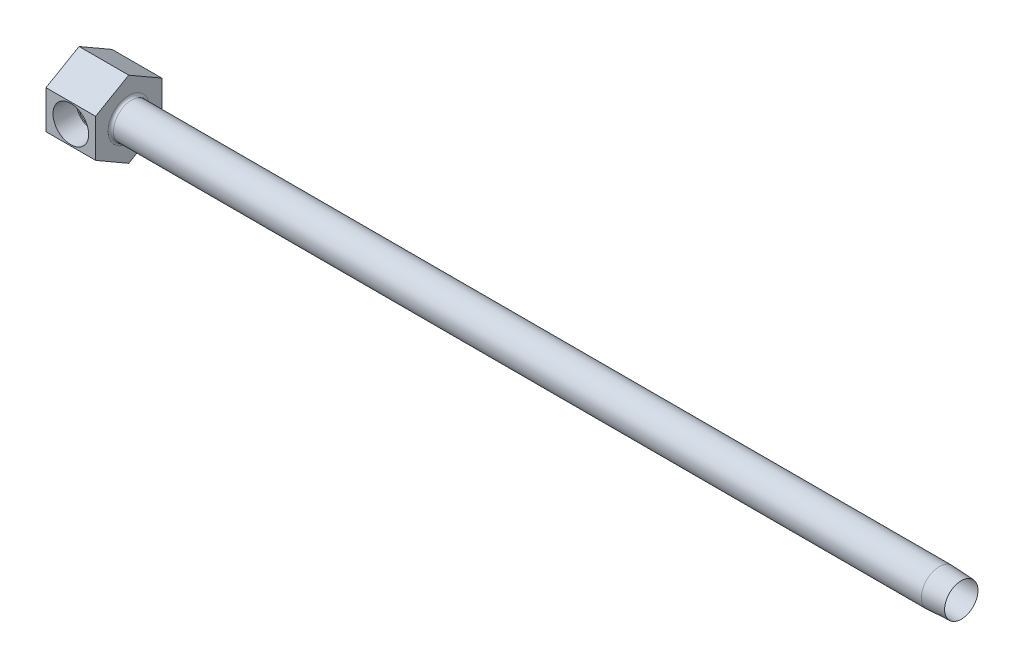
ISO-10303-21;
HEADER;
FILE_DESCRIPTION(('STEP AP214'),'2;1');
FILE_NAME('part.step','',(''),(''),'','','');
FILE_SCHEMA(('AUTOMOTIVE_DESIGN { 1 0 10303 214 1 1 1 1 }'));
ENDSEC;
DATA;
#1=APPLICATION_CONTEXT('core data for automotive mechanical design processes');
#2=APPLICATION_PROTOCOL_DEFINITION('international standard','automotive_design',2000,#1);
#3=PRODUCT_CONTEXT('',#1,'mechanical');
#4=PRODUCT('Part','Part','',(#3));
#5=PRODUCT_RELATED_PRODUCT_CATEGORY('part','',(#4));
#6=PRODUCT_DEFINITION_FORMATION('','',#4);
#7=PRODUCT_DEFINITION_CONTEXT('part definition',#1,'design');
#8=PRODUCT_DEFINITION('design','',#6,#7);
#9=PRODUCT_DEFINITION_SHAPE('','',#8);
#10=(LENGTH_UNIT() NAMED_UNIT(*) SI_UNIT(.MILLI.,.METRE.));
#11=(NAMED_UNIT(*) PLANE_ANGLE_UNIT() SI_UNIT($,.RADIAN.));
#12=(NAMED_UNIT(*) SI_UNIT($,.STERADIAN.) SOLID_ANGLE_UNIT());
#13=UNCERTAINTY_MEASURE_WITH_UNIT(LENGTH_MEASURE(1.E-05),#10,'distance_accuracy_value','');
#14=(GEOMETRIC_REPRESENTATION_CONTEXT(3) GLOBAL_UNCERTAINTY_ASSIGNED_CONTEXT((#13)) GLOBAL_UNIT_ASSIGNED_CONTEXT((#10,
#11,#12)) REPRESENTATION_CONTEXT('',''));
#15=CARTESIAN_POINT('',(0.,0.,0.));
#16=DIRECTION('',(0.,0.,1.));
#17=DIRECTION('',(1.,0.,0.));
#18=AXIS2_PLACEMENT_3D('',#15,#16,#17);
#19=CARTESIAN_POINT('',(63.5,0.,9.525));
#20=DIRECTION('',(1.,0.,0.));
#21=DIRECTION('',(0.,0.,-1.));
#22=AXIS2_PLACEMENT_3D('',#19,#20,#21);
#23=CONICAL_SURFACE('',#22,0.,0.0252477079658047);
#24=CARTESIAN_POINT('',(254.,0.,9.525));
#25=DIRECTION('',(-1.,0.,0.));
#26=DIRECTION('',(0.,0.,1.));
#27=AXIS2_PLACEMENT_3D('',#24,#25,#26);
#28=CIRCLE('',#27,4.81071060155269);
#29=CARTESIAN_POINT('',(254.,0.,14.3357106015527));
#30=VERTEX_POINT('',#29);
#31=EDGE_CURVE('E262',#30,#30,#28,.T.);
#32=ORIENTED_EDGE('',*,*,#31,.F.);
#33=EDGE_LOOP('',(#32));
#34=FACE_BOUND('',#33,.T.);
#35=CARTESIAN_POINT('',(236.374993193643,0.,9.525));
#36=DIRECTION('',(1.,0.,0.));
#37=DIRECTION('',(0.,0.,-1.));
#38=AXIS2_PLACEMENT_3D('',#35,#36,#37);
#39=CIRCLE('',#38,4.365625);
#40=CARTESIAN_POINT('',(236.374993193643,0.,5.159375));
#41=VERTEX_POINT('',#40);
#42=EDGE_CURVE('E111',#41,#41,#39,.T.);
#43=ORIENTED_EDGE('',*,*,#42,.F.);
#44=EDGE_LOOP('',(#43));
#45=FACE_BOUND('',#44,.T.);
#46=ADVANCED_FACE('F15',(#34,#45),#23,.F.);
#47=CARTESIAN_POINT('',(7.14375,0.,19.05));
#48=DIRECTION('',(0.,0.,1.));
#49=DIRECTION('',(1.,0.,0.));
#50=AXIS2_PLACEMENT_3D('',#47,#48,#49);
#51=CONICAL_SURFACE('',#50,5.1435,0.0523598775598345);
#52=CARTESIAN_POINT('',(7.14375,0.,19.05));
#53=DIRECTION('',(0.,0.,-1.));
#54=DIRECTION('',(-1.,0.,0.));
#55=AXIS2_PLACEMENT_3D('',#52,#53,#54);
#56=CIRCLE('',#55,5.1435);
#57=CARTESIAN_POINT('',(2.00025,0.,19.05));
#58=VERTEX_POINT('',#57);
#59=EDGE_CURVE('E290',#58,#58,#56,.T.);
#60=ORIENTED_EDGE('',*,*,#59,.F.);
#61=EDGE_LOOP('',(#60));
#62=FACE_BOUND('',#61,.T.);
#63=CARTESIAN_POINT('',(7.14375,0.,12.7000000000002));
#64=DIRECTION('',(0.,0.,-1.));
#65=DIRECTION('',(-1.,0.,0.));
#66=AXIS2_PLACEMENT_3D('',#63,#64,#65);
#67=CIRCLE('',#66,4.81071060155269);
#68=CARTESIAN_POINT('',(10.9073758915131,-2.99634054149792,12.7000000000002));
#69=VERTEX_POINT('',#68);
#70=CARTESIAN_POINT('',(10.9073758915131,2.99634054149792,12.7000000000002));
#71=VERTEX_POINT('',#70);
#72=EDGE_CURVE('E292',#69,#71,#67,.T.);
#73=ORIENTED_EDGE('',*,*,#72,.T.);
#74=CARTESIAN_POINT('',(10.9071937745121,2.99655245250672,12.6998000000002));
#75=CARTESIAN_POINT('',(10.971635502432,2.92155827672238,12.7705639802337));
#76=CARTESIAN_POINT('',(11.0345784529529,2.84341410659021,12.8393139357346));
#77=CARTESIAN_POINT('',(11.1569073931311,2.68056902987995,12.9723675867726));
#78=CARTESIAN_POINT('',(11.2162880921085,2.59585877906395,13.0366646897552));
#79=CARTESIAN_POINT('',(11.3887731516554,2.33059710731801,13.2228141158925));
#80=CARTESIAN_POINT('',(11.4952955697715,2.13996459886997,13.3369144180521));
#81=CARTESIAN_POINT('',(11.6670238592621,1.76978922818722,13.520146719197));
#82=CARTESIAN_POINT('',(11.7362081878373,1.59429861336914,13.5936668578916));
#83=CARTESIAN_POINT('',(11.8243838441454,1.32069459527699,13.6871793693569));
#84=CARTESIAN_POINT('',(11.8511557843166,1.22786736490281,13.7155347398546));
#85=CARTESIAN_POINT('',(11.8990876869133,1.0391950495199,13.7662595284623));
#86=CARTESIAN_POINT('',(11.9202500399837,0.943351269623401,13.7886314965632));
#87=CARTESIAN_POINT('',(11.9566990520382,0.748466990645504,13.8271421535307));
#88=CARTESIAN_POINT('',(11.971935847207,0.649406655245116,13.8432279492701));
#89=CARTESIAN_POINT('',(11.9959472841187,0.449682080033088,13.8685692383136));
#90=CARTESIAN_POINT('',(12.0047249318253,0.349018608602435,13.8778279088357));
#91=CARTESIAN_POINT('',(12.0156291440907,0.146869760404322,13.8893288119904));
#92=CARTESIAN_POINT('',(12.0177517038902,0.0453839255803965,13.8915668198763));
#93=CARTESIAN_POINT('',(12.0152840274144,-0.157407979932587,13.8889645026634));
#94=CARTESIAN_POINT('',(12.0106943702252,-0.258714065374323,13.8841247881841));
#95=CARTESIAN_POINT('',(11.9957865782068,-0.449057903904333,13.8683984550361));
#96=CARTESIAN_POINT('',(11.9861593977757,-0.538211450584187,13.8582411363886));
#97=CARTESIAN_POINT('',(11.961864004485,-0.715062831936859,13.8325939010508));
#98=CARTESIAN_POINT('',(11.9471941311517,-0.802760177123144,13.8171022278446));
#99=CARTESIAN_POINT('',(11.8959888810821,-1.06271154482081,13.762990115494));
#100=CARTESIAN_POINT('',(11.8522396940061,-1.23204639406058,13.7167134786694));
#101=CARTESIAN_POINT('',(11.7458224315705,-1.56656708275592,13.6038703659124));
#102=CARTESIAN_POINT('',(11.6823922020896,-1.73122409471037,13.5364852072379));
#103=CARTESIAN_POINT('',(11.5406571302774,-2.04618319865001,13.3853583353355));
#104=CARTESIAN_POINT('',(11.4623317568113,-2.19646504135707,13.3015940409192));
#105=CARTESIAN_POINT('',(11.3067680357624,-2.45998630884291,13.1343941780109));
#106=CARTESIAN_POINT('',(11.2311482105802,-2.57539375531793,13.0528153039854));
#107=CARTESIAN_POINT('',(11.0735639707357,-2.79452635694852,12.8818550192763));
#108=CARTESIAN_POINT('',(10.9916301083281,-2.89830245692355,12.792510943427));
#109=CARTESIAN_POINT('',(10.9071937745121,-2.99655245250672,12.6998000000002));
#110=B_SPLINE_CURVE_WITH_KNOTS('',3,(#74,#75,#76,#77,#78,#79,#80,#81,#82,#83,#84,#85,#86,#87,
#88,#89,#90,#91,#92,#93,#94,#95,#96,#97,#98,#99,#100,#101,#102,#103,#104,#105,#106,#107,#108,
#109),.UNSPECIFIED.,.F.,.F.,(4,2,2,2,2,2,2,2,2,2,2,2,2,2,2,2,2,4),(0.,0.364634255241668,
0.72979730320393,1.46525067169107,2.06997219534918,2.37170467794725,2.67330836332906,
2.97739780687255,3.28134564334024,3.58547634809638,3.88958081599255,4.15999530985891,
4.43049893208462,4.97084503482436,5.53548493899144,6.10090884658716,6.58103480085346,
7.05896806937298),.UNSPECIFIED.);
#111=EDGE_CURVE('E121',#71,#69,#110,.T.);
#112=ORIENTED_EDGE('',*,*,#111,.T.);
#113=EDGE_LOOP('',(#73,#112));
#114=FACE_BOUND('',#113,.T.);
#115=ADVANCED_FACE('F173',(#62,#114),#51,.F.);
#116=CARTESIAN_POINT('',(11.9544606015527,0.,12.7000000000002));
#117=DIRECTION('',(0.,0.,1.));
#118=DIRECTION('',(1.,0.,0.));
#119=AXIS2_PLACEMENT_3D('',#116,#117,#118);
#120=PLANE('',#119);
#121=ORIENTED_EDGE('',*,*,#72,.F.);
#122=DIRECTION('',(1.,0.,0.));
#123=VECTOR('',#122,1.);
#124=CARTESIAN_POINT('',(66.1375087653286,-2.99634054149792,12.7000000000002));
#125=LINE('',#124,#123);
#126=CARTESIAN_POINT('',(10.3187500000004,-2.99634054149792,12.7000000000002));
#127=VERTEX_POINT('',#126);
#128=EDGE_CURVE('E118',#69,#127,#125,.F.);
#129=ORIENTED_EDGE('',*,*,#128,.T.);
#130=CARTESIAN_POINT('',(7.14375,0.,12.7000000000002));
#131=DIRECTION('',(0.,0.,-1.));
#132=DIRECTION('',(-1.,0.,0.));
#133=AXIS2_PLACEMENT_3D('',#130,#131,#132);
#134=CIRCLE('',#133,4.36562500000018);
#135=CARTESIAN_POINT('',(10.3187500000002,2.99634054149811,12.7000000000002));
#136=VERTEX_POINT('',#135);
#137=EDGE_CURVE('E117',#127,#136,#134,.T.);
#138=ORIENTED_EDGE('',*,*,#137,.T.);
#139=DIRECTION('',(1.,0.,0.));
#140=VECTOR('',#139,1.);
#141=CARTESIAN_POINT('',(66.1375087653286,2.99634054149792,12.7000000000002));
#142=LINE('',#141,#140);
#143=EDGE_CURVE('E124',#136,#71,#142,.T.);
#144=ORIENTED_EDGE('',*,*,#143,.T.);
#145=EDGE_LOOP('',(#121,#129,#138,#144));
#146=FACE_BOUND('',#145,.T.);
#147=ADVANCED_FACE('F178',(#146),#120,.T.);
#148=CARTESIAN_POINT('',(7.14375,0.,35.9059426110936));
#149=DIRECTION('',(0.,0.,-1.));
#150=DIRECTION('',(-1.,0.,0.));
#151=AXIS2_PLACEMENT_3D('',#148,#149,#150);
#152=CYLINDRICAL_SURFACE('',#151,4.36562500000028);
#153=ORIENTED_EDGE('',*,*,#137,.F.);
#154=CARTESIAN_POINT('',(7.14375,0.,9.525));
#155=DIRECTION('',(0.707106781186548,0.,-0.707106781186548));
#156=DIRECTION('',(-0.707106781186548,0.,-0.707106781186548));
#157=AXIS2_PLACEMENT_3D('',#154,#155,#156);
#158=ELLIPSE('',#157,6.17392608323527,4.36562500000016);
#159=CARTESIAN_POINT('',(7.14375,-4.3656250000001,9.525));
#160=VERTEX_POINT('',#159);
#161=EDGE_CURVE('E103',#127,#160,#158,.T.);
#162=ORIENTED_EDGE('',*,*,#161,.T.);
#163=CARTESIAN_POINT('',(7.14375,0.,9.525));
#164=DIRECTION('',(-0.707106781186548,0.,-0.707106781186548));
#165=DIRECTION('',(0.707106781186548,0.,-0.707106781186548));
#166=AXIS2_PLACEMENT_3D('',#163,#164,#165);
#167=ELLIPSE('',#166,6.17392608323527,4.36562500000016);
#168=CARTESIAN_POINT('',(8.98888023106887,-3.95653586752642,7.67986976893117));
#169=VERTEX_POINT('',#168);
#170=EDGE_CURVE('E100',#160,#169,#167,.F.);
#171=ORIENTED_EDGE('',*,*,#170,.T.);
#172=CARTESIAN_POINT('',(7.14375,0.,7.67986976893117));
#173=DIRECTION('',(0.,0.,-1.));
#174=DIRECTION('',(-1.,0.,0.));
#175=AXIS2_PLACEMENT_3D('',#172,#173,#174);
#176=CIRCLE('',#175,4.36562500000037);
#177=CARTESIAN_POINT('',(8.98888023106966,3.95653586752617,7.67986976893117));
#178=VERTEX_POINT('',#177);
#179=EDGE_CURVE('E305',#169,#178,#176,.T.);
#180=ORIENTED_EDGE('',*,*,#179,.T.);
#181=CARTESIAN_POINT('',(7.14375,4.3656250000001,9.525));
#182=VERTEX_POINT('',#181);
#183=EDGE_CURVE('E30',#178,#182,#167,.F.);
#184=ORIENTED_EDGE('',*,*,#183,.T.);
#185=EDGE_CURVE('E120',#182,#136,#158,.T.);
#186=ORIENTED_EDGE('',*,*,#185,.T.);
#187=EDGE_LOOP('',(#153,#162,#171,#180,#184,#186));
#188=FACE_BOUND('',#187,.T.);
#189=ADVANCED_FACE('F114',(#188),#152,.F.);
#190=CARTESIAN_POINT('',(7.14375,0.,7.67986976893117));
#191=DIRECTION('',(0.,0.,1.));
#192=DIRECTION('',(1.,0.,0.));
#193=AXIS2_PLACEMENT_3D('',#190,#191,#192);
#194=CONICAL_SURFACE('',#193,4.36562500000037,1.0471975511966);
#195=ORIENTED_EDGE('',*,*,#179,.F.);
#196=CARTESIAN_POINT('',(8.9894997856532,-3.95662913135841,7.68006976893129));
#197=CARTESIAN_POINT('',(8.91497560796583,-3.94541760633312,7.6560189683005));
#198=CARTESIAN_POINT('',(8.84020256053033,-3.93428272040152,7.6327193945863));
#199=CARTESIAN_POINT('',(8.69001846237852,-3.91242782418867,7.58793860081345));
#200=CARTESIAN_POINT('',(8.61460714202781,-3.90170800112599,7.56645819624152));
#201=CARTESIAN_POINT('',(8.38848524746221,-3.87074056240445,7.50556917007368));
#202=CARTESIAN_POINT('',(8.2367287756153,-3.8515020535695,7.46932807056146));
#203=CARTESIAN_POINT('',(8.00667896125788,-3.82676825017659,7.42384959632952));
#204=CARTESIAN_POINT('',(7.92948623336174,-3.81920348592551,7.41015805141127));
#205=CARTESIAN_POINT('',(7.77441965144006,-3.80585437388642,7.38622945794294));
#206=CARTESIAN_POINT('',(7.69654594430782,-3.80006965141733,7.37599168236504));
#207=CARTESIAN_POINT('',(7.53967894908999,-3.79060206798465,7.35933225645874));
#208=CARTESIAN_POINT('',(7.46068163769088,-3.78693482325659,7.35293894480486));
#209=CARTESIAN_POINT('',(7.30231301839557,-3.7819879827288,7.34434534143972));
#210=CARTESIAN_POINT('',(7.2229414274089,-3.78071064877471,7.34214902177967));
#211=CARTESIAN_POINT('',(7.14355,-3.78074215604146,7.34218750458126));
#212=B_SPLINE_CURVE_WITH_KNOTS('',3,(#196,#197,#198,#199,#200,#201,#202,#203,#204,#205,#206,
#207,#208,#209,#210,#211),.UNSPECIFIED.,.F.,.F.,(4,2,2,2,2,2,2,4),(0.,0.237303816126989,
0.474713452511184,0.945835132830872,1.18204117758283,1.41819746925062,1.65607385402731,
1.89417525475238),.UNSPECIFIED.);
#213=CARTESIAN_POINT('',(7.14375,-3.78074215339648,7.34218750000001));
#214=VERTEX_POINT('',#213);
#215=EDGE_CURVE('E107',#169,#214,#212,.T.);
#216=ORIENTED_EDGE('',*,*,#215,.T.);
#217=DIRECTION('',(0.,0.866025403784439,-0.5));
#218=VECTOR('',#217,1.);
#219=CARTESIAN_POINT('',(7.14375,0.,5.159375));
#220=LINE('',#219,#218);
#221=CARTESIAN_POINT('',(7.14375,0.,5.159375));
#222=VERTEX_POINT('',#221);
#223=EDGE_CURVE('E140',#214,#222,#220,.T.);
#224=ORIENTED_EDGE('',*,*,#223,.T.);
#225=DIRECTION('',(0.,0.866025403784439,0.5));
#226=VECTOR('',#225,1.);
#227=CARTESIAN_POINT('',(7.14375,0.,5.159375));
#228=LINE('',#227,#226);
#229=CARTESIAN_POINT('',(7.14375,3.78074215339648,7.34218750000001));
#230=VERTEX_POINT('',#229);
#231=EDGE_CURVE('E135',#222,#230,#228,.T.);
#232=ORIENTED_EDGE('',*,*,#231,.T.);
#233=CARTESIAN_POINT('',(7.14355,3.78074215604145,7.34218750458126));
#234=CARTESIAN_POINT('',(7.20515303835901,3.78073202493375,7.34217451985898));
#235=CARTESIAN_POINT('',(7.26674694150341,3.78149280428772,7.34348695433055));
#236=CARTESIAN_POINT('',(7.38976236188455,3.78448017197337,7.34867189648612));
#237=CARTESIAN_POINT('',(7.45118394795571,3.78670605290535,7.3525431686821));
#238=CARTESIAN_POINT('',(7.63466542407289,3.79545033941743,7.36782927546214));
#239=CARTESIAN_POINT('',(7.75632841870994,3.80403629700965,7.38291749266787));
#240=CARTESIAN_POINT('',(8.11659337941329,3.83592256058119,7.44024735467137));
#241=CARTESIAN_POINT('',(8.35266311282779,3.8653919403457,7.49460284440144));
#242=CARTESIAN_POINT('',(8.65303625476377,3.90716169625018,7.57737916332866));
#243=CARTESIAN_POINT('',(8.72054620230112,3.91683509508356,7.59689306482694));
#244=CARTESIAN_POINT('',(8.855265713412,3.93652410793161,7.63741882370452));
#245=CARTESIAN_POINT('',(8.92247399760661,3.94654056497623,7.65843453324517));
#246=CARTESIAN_POINT('',(8.9894997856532,3.9566291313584,7.68006976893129));
#247=B_SPLINE_CURVE_WITH_KNOTS('',3,(#233,#234,#235,#236,#237,#238,#239,#240,#241,#242,#243,
#244,#245,#246),.UNSPECIFIED.,.F.,.F.,(4,2,2,2,2,2,4),(0.,0.184774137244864,0.369459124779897,
0.73767480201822,1.46761028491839,1.68043381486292,1.89382432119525),.UNSPECIFIED.);
#248=EDGE_CURVE('E139',#230,#178,#247,.T.);
#249=ORIENTED_EDGE('',*,*,#248,.T.);
#250=EDGE_LOOP('',(#195,#216,#224,#232,#249));
#251=FACE_BOUND('',#250,.T.);
#252=ADVANCED_FACE('F138',(#251),#194,.F.);
#253=CARTESIAN_POINT('',(14.2875,5.4992613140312,19.05));
#254=DIRECTION('',(0.,0.,-1.));
#255=DIRECTION('',(-1.,0.,0.));
#256=AXIS2_PLACEMENT_3D('',#253,#254,#255);
#257=PLANE('',#256);
#258=DIRECTION('',(0.,-1.,0.));
#259=VECTOR('',#258,1.);
#260=CARTESIAN_POINT('',(0.,5.4992613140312,19.05));
#261=LINE('',#260,#259);
#262=CARTESIAN_POINT('',(0.,5.4992613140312,19.05));
#263=VERTEX_POINT('',#262);
#264=CARTESIAN_POINT('',(0.,-5.49926131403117,19.05));
#265=VERTEX_POINT('',#264);
#266=EDGE_CURVE('E250',#263,#265,#261,.T.);
#267=ORIENTED_EDGE('',*,*,#266,.T.);
#268=DIRECTION('',(-1.,0.,0.));
#269=VECTOR('',#268,1.);
#270=CARTESIAN_POINT('',(14.2875,-5.49926131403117,19.05));
#271=LINE('',#270,#269);
#272=CARTESIAN_POINT('',(14.2875,-5.49926131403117,19.05));
#273=VERTEX_POINT('',#272);
#274=EDGE_CURVE('E275',#273,#265,#271,.T.);
#275=ORIENTED_EDGE('',*,*,#274,.F.);
#276=DIRECTION('',(0.,-1.,0.));
#277=VECTOR('',#276,1.);
#278=CARTESIAN_POINT('',(14.2875,5.4992613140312,19.05));
#279=LINE('',#278,#277);
#280=CARTESIAN_POINT('',(14.2875,5.4992613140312,19.05));
#281=VERTEX_POINT('',#280);
#282=EDGE_CURVE('E268',#281,#273,#279,.T.);
#283=ORIENTED_EDGE('',*,*,#282,.F.);
#284=DIRECTION('',(-1.,0.,0.));
#285=VECTOR('',#284,1.);
#286=CARTESIAN_POINT('',(14.2875,5.4992613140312,19.05));
#287=LINE('',#286,#285);
#288=EDGE_CURVE('E278',#281,#263,#287,.T.);
#289=ORIENTED_EDGE('',*,*,#288,.T.);
#290=EDGE_LOOP('',(#267,#275,#283,#289));
#291=FACE_BOUND('',#290,.T.);
#292=ORIENTED_EDGE('',*,*,#59,.T.);
#293=EDGE_LOOP('',(#292));
#294=FACE_BOUND('',#293,.T.);
#295=ADVANCED_FACE('F199',(#291,#294),#257,.F.);
#296=CARTESIAN_POINT('',(14.2875,-5.49926131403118,0.));
#297=DIRECTION('',(1.,0.,0.));
#298=DIRECTION('',(0.,1.,0.));
#299=AXIS2_PLACEMENT_3D('',#296,#297,#298);
#300=PLANE('',#299);
#301=CARTESIAN_POINT('',(14.2875,0.,9.525));
#302=DIRECTION('',(1.,0.,0.));
#303=DIRECTION('',(0.,1.,0.));
#304=AXIS2_PLACEMENT_3D('',#301,#302,#303);
#305=CIRCLE('',#304,5.9309);
#306=CARTESIAN_POINT('',(14.2875,5.9309,9.525));
#307=VERTEX_POINT('',#306);
#308=EDGE_CURVE('E23',#307,#307,#305,.F.);
#309=ORIENTED_EDGE('',*,*,#308,.T.);
#310=EDGE_LOOP('',(#309));
#311=FACE_BOUND('',#310,.T.);
#312=DIRECTION('',(0.,0.5,-0.866025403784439));
#313=VECTOR('',#312,1.);
#314=CARTESIAN_POINT('',(14.2875,-10.9985226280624,9.525));
#315=LINE('',#314,#313);
#316=CARTESIAN_POINT('',(14.2875,-10.9985226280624,9.525));
#317=VERTEX_POINT('',#316);
#318=CARTESIAN_POINT('',(14.2875,-5.49926131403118,0.));
#319=VERTEX_POINT('',#318);
#320=EDGE_CURVE('E259',#317,#319,#315,.T.);
#321=ORIENTED_EDGE('',*,*,#320,.T.);
#322=DIRECTION('',(0.,1.,0.));
#323=VECTOR('',#322,1.);
#324=CARTESIAN_POINT('',(14.2875,-5.49926131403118,0.));
#325=LINE('',#324,#323);
#326=CARTESIAN_POINT('',(14.2875,5.49926131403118,0.));
#327=VERTEX_POINT('',#326);
#328=EDGE_CURVE('E263',#319,#327,#325,.T.);
#329=ORIENTED_EDGE('',*,*,#328,.T.);
#330=DIRECTION('',(0.,0.5,0.866025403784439));
#331=VECTOR('',#330,1.);
#332=CARTESIAN_POINT('',(14.2875,5.49926131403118,0.));
#333=LINE('',#332,#331);
#334=CARTESIAN_POINT('',(14.2875,10.9985226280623,9.525));
#335=VERTEX_POINT('',#334);
#336=EDGE_CURVE('E239',#327,#335,#333,.T.);
#337=ORIENTED_EDGE('',*,*,#336,.T.);
#338=DIRECTION('',(0.,-0.5,0.86602540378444));
#339=VECTOR('',#338,1.);
#340=CARTESIAN_POINT('',(14.2875,10.9985226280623,9.525));
#341=LINE('',#340,#339);
#342=EDGE_CURVE('E266',#335,#281,#341,.T.);
#343=ORIENTED_EDGE('',*,*,#342,.T.);
#344=ORIENTED_EDGE('',*,*,#282,.T.);
#345=DIRECTION('',(0.,-0.5,-0.866025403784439));
#346=VECTOR('',#345,1.);
#347=CARTESIAN_POINT('',(14.2875,-5.49926131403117,19.05));
#348=LINE('',#347,#346);
#349=EDGE_CURVE('E38',#273,#317,#348,.T.);
#350=ORIENTED_EDGE('',*,*,#349,.T.);
#351=EDGE_LOOP('',(#321,#329,#337,#343,#344,#350));
#352=FACE_BOUND('',#351,.T.);
#353=ADVANCED_FACE('F196',(#311,#352),#300,.T.);
#354=CARTESIAN_POINT('',(14.2875,-10.9985226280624,9.525));
#355=DIRECTION('',(0.,0.866025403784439,0.5));
#356=DIRECTION('',(0.,-0.5,0.866025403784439));
#357=AXIS2_PLACEMENT_3D('',#354,#355,#356);
#358=PLANE('',#357);
#359=DIRECTION('',(0.,0.5,-0.866025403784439));
#360=VECTOR('',#359,1.);
#361=CARTESIAN_POINT('',(0.,-10.9985226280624,9.525));
#362=LINE('',#361,#360);
#363=CARTESIAN_POINT('',(0.,-10.9985226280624,9.525));
#364=VERTEX_POINT('',#363);
#365=CARTESIAN_POINT('',(0.,-5.49926131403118,0.));
#366=VERTEX_POINT('',#365);
#367=EDGE_CURVE('E235',#364,#366,#362,.T.);
#368=ORIENTED_EDGE('',*,*,#367,.T.);
#369=DIRECTION('',(-1.,0.,0.));
#370=VECTOR('',#369,1.);
#371=CARTESIAN_POINT('',(14.2875,-5.49926131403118,0.));
#372=LINE('',#371,#370);
#373=EDGE_CURVE('E143',#319,#366,#372,.T.);
#374=ORIENTED_EDGE('',*,*,#373,.F.);
#375=ORIENTED_EDGE('',*,*,#320,.F.);
#376=DIRECTION('',(-1.,0.,0.));
#377=VECTOR('',#376,1.);
#378=CARTESIAN_POINT('',(14.2875,-10.9985226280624,9.525));
#379=LINE('',#378,#377);
#380=EDGE_CURVE('E271',#317,#364,#379,.T.);
#381=ORIENTED_EDGE('',*,*,#380,.T.);
#382=EDGE_LOOP('',(#368,#374,#375,#381));
#383=FACE_BOUND('',#382,.T.);
#384=ADVANCED_FACE('F17',(#383),#358,.F.);
#385=CARTESIAN_POINT('',(14.2875,-5.49926131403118,0.));
#386=DIRECTION('',(0.,0.,1.));
#387=DIRECTION('',(0.,-1.,0.));
#388=AXIS2_PLACEMENT_3D('',#385,#386,#387);
#389=PLANE('',#388);
#390=DIRECTION('',(0.,1.,0.));
#391=VECTOR('',#390,1.);
#392=CARTESIAN_POINT('',(0.,-5.49926131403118,0.));
#393=LINE('',#392,#391);
#394=CARTESIAN_POINT('',(0.,5.49926131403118,0.));
#395=VERTEX_POINT('',#394);
#396=EDGE_CURVE('E225',#366,#395,#393,.T.);
#397=ORIENTED_EDGE('',*,*,#396,.T.);
#398=DIRECTION('',(-1.,0.,0.));
#399=VECTOR('',#398,1.);
#400=CARTESIAN_POINT('',(14.2875,5.49926131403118,0.));
#401=LINE('',#400,#399);
#402=EDGE_CURVE('E227',#327,#395,#401,.T.);
#403=ORIENTED_EDGE('',*,*,#402,.F.);
#404=ORIENTED_EDGE('',*,*,#328,.F.);
#405=ORIENTED_EDGE('',*,*,#373,.T.);
#406=EDGE_LOOP('',(#397,#403,#404,#405));
#407=FACE_BOUND('',#406,.T.);
#408=ADVANCED_FACE('F213',(#407),#389,.F.);
#409=CARTESIAN_POINT('',(14.2875,5.49926131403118,0.));
#410=DIRECTION('',(0.,-0.866025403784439,0.5));
#411=DIRECTION('',(0.,-0.5,-0.866025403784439));
#412=AXIS2_PLACEMENT_3D('',#409,#410,#411);
#413=PLANE('',#412);
#414=DIRECTION('',(0.,0.5,0.866025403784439));
#415=VECTOR('',#414,1.);
#416=CARTESIAN_POINT('',(0.,5.49926131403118,0.));
#417=LINE('',#416,#415);
#418=CARTESIAN_POINT('',(0.,10.9985226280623,9.525));
#419=VERTEX_POINT('',#418);
#420=EDGE_CURVE('E234',#395,#419,#417,.T.);
#421=ORIENTED_EDGE('',*,*,#420,.T.);
#422=DIRECTION('',(-1.,0.,0.));
#423=VECTOR('',#422,1.);
#424=CARTESIAN_POINT('',(14.2875,10.9985226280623,9.525));
#425=LINE('',#424,#423);
#426=EDGE_CURVE('E240',#335,#419,#425,.T.);
#427=ORIENTED_EDGE('',*,*,#426,.F.);
#428=ORIENTED_EDGE('',*,*,#336,.F.);
#429=ORIENTED_EDGE('',*,*,#402,.T.);
#430=EDGE_LOOP('',(#421,#427,#428,#429));
#431=FACE_BOUND('',#430,.T.);
#432=ADVANCED_FACE('F210',(#431),#413,.F.);
#433=CARTESIAN_POINT('',(14.2875,10.9985226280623,9.525));
#434=DIRECTION('',(0.,-0.86602540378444,-0.5));
#435=DIRECTION('',(0.,0.5,-0.86602540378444));
#436=AXIS2_PLACEMENT_3D('',#433,#434,#435);
#437=PLANE('',#436);
#438=DIRECTION('',(0.,-0.5,0.86602540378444));
#439=VECTOR('',#438,1.);
#440=CARTESIAN_POINT('',(0.,10.9985226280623,9.525));
#441=LINE('',#440,#439);
#442=EDGE_CURVE('E244',#419,#263,#441,.T.);
#443=ORIENTED_EDGE('',*,*,#442,.T.);
#444=ORIENTED_EDGE('',*,*,#288,.F.);
#445=ORIENTED_EDGE('',*,*,#342,.F.);
#446=ORIENTED_EDGE('',*,*,#426,.T.);
#447=EDGE_LOOP('',(#443,#444,#445,#446));
#448=FACE_BOUND('',#447,.T.);
#449=ADVANCED_FACE('F203',(#448),#437,.F.);
#450=CARTESIAN_POINT('',(14.2875,-5.49926131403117,19.05));
#451=DIRECTION('',(0.,0.866025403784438,-0.5));
#452=DIRECTION('',(0.,0.5,0.866025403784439));
#453=AXIS2_PLACEMENT_3D('',#450,#451,#452);
#454=PLANE('',#453);
#455=DIRECTION('',(0.,-0.5,-0.866025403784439));
#456=VECTOR('',#455,1.);
#457=CARTESIAN_POINT('',(0.,-5.49926131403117,19.05));
#458=LINE('',#457,#456);
#459=EDGE_CURVE('E256',#265,#364,#458,.T.);
#460=ORIENTED_EDGE('',*,*,#459,.T.);
#461=ORIENTED_EDGE('',*,*,#380,.F.);
#462=ORIENTED_EDGE('',*,*,#349,.F.);
#463=ORIENTED_EDGE('',*,*,#274,.T.);
#464=EDGE_LOOP('',(#460,#461,#462,#463));
#465=FACE_BOUND('',#464,.T.);
#466=ADVANCED_FACE('F194',(#465),#454,.F.);
#467=CARTESIAN_POINT('',(0.,-5.49926131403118,0.));
#468=DIRECTION('',(1.,0.,0.));
#469=DIRECTION('',(0.,1.,0.));
#470=AXIS2_PLACEMENT_3D('',#467,#468,#469);
#471=PLANE('',#470);
#472=ORIENTED_EDGE('',*,*,#367,.F.);
#473=ORIENTED_EDGE('',*,*,#459,.F.);
#474=ORIENTED_EDGE('',*,*,#266,.F.);
#475=ORIENTED_EDGE('',*,*,#442,.F.);
#476=ORIENTED_EDGE('',*,*,#420,.F.);
#477=ORIENTED_EDGE('',*,*,#396,.F.);
#478=EDGE_LOOP('',(#472,#473,#474,#475,#476,#477));
#479=FACE_BOUND('',#478,.T.);
#480=ADVANCED_FACE('F190',(#479),#471,.F.);
#481=CARTESIAN_POINT('',(68.0114010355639,0.,9.525));
#482=DIRECTION('',(-1.,0.,0.));
#483=DIRECTION('',(0.,0.,1.));
#484=AXIS2_PLACEMENT_3D('',#481,#482,#483);
#485=CYLINDRICAL_SURFACE('',#484,5.1435);
#486=CARTESIAN_POINT('',(15.0749,0.,9.525));
#487=DIRECTION('',(1.,0.,0.));
#488=DIRECTION('',(0.,1.,0.));
#489=AXIS2_PLACEMENT_3D('',#486,#487,#488);
#490=CIRCLE('',#489,5.1435);
#491=CARTESIAN_POINT('',(15.0749,5.1435,9.525));
#492=VERTEX_POINT('',#491);
#493=EDGE_CURVE('E10',#492,#492,#490,.T.);
#494=ORIENTED_EDGE('',*,*,#493,.T.);
#495=EDGE_LOOP('',(#494));
#496=FACE_BOUND('',#495,.T.);
#497=CARTESIAN_POINT('',(247.65,0.,9.525));
#498=DIRECTION('',(-1.,0.,0.));
#499=DIRECTION('',(0.,0.,1.));
#500=AXIS2_PLACEMENT_3D('',#497,#498,#499);
#501=CIRCLE('',#500,5.1435);
#502=CARTESIAN_POINT('',(247.65,0.,14.6685));
#503=VERTEX_POINT('',#502);
#504=EDGE_CURVE('E291',#503,#503,#501,.T.);
#505=ORIENTED_EDGE('',*,*,#504,.T.);
#506=EDGE_LOOP('',(#505));
#507=FACE_BOUND('',#506,.T.);
#508=ADVANCED_FACE('F183',(#496,#507),#485,.T.);
#509=CARTESIAN_POINT('',(254.,0.,9.525));
#510=DIRECTION('',(-1.,0.,0.));
#511=DIRECTION('',(0.,0.,1.));
#512=AXIS2_PLACEMENT_3D('',#509,#510,#511);
#513=CONICAL_SURFACE('',#512,4.81071060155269,0.0523598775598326);
#514=ORIENTED_EDGE('',*,*,#504,.F.);
#515=EDGE_LOOP('',(#514));
#516=FACE_BOUND('',#515,.T.);
#517=ORIENTED_EDGE('',*,*,#31,.T.);
#518=EDGE_LOOP('',(#517));
#519=FACE_BOUND('',#518,.T.);
#520=ADVANCED_FACE('F180',(#516,#519),#513,.T.);
#521=CARTESIAN_POINT('',(7.14375,0.,9.525));
#522=DIRECTION('',(1.,0.,0.));
#523=DIRECTION('',(0.,0.,-1.));
#524=AXIS2_PLACEMENT_3D('',#521,#522,#523);
#525=PLANE('',#524);
#526=CARTESIAN_POINT('',(7.14375,0.,9.525));
#527=DIRECTION('',(1.,0.,0.));
#528=DIRECTION('',(0.,0.,-1.));
#529=AXIS2_PLACEMENT_3D('',#526,#527,#528);
#530=CIRCLE('',#529,4.365625);
#531=EDGE_CURVE('E128',#222,#230,#530,.T.);
#532=ORIENTED_EDGE('',*,*,#531,.T.);
#533=ORIENTED_EDGE('',*,*,#231,.F.);
#534=EDGE_LOOP('',(#532,#533));
#535=FACE_BOUND('',#534,.T.);
#536=ADVANCED_FACE('F134',(#535),#525,.T.);
#537=CARTESIAN_POINT('',(66.1375087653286,0.,9.525));
#538=DIRECTION('',(1.,0.,0.));
#539=DIRECTION('',(0.,0.,-1.));
#540=AXIS2_PLACEMENT_3D('',#537,#538,#539);
#541=CYLINDRICAL_SURFACE('',#540,4.365625);
#542=ORIENTED_EDGE('',*,*,#42,.T.);
#543=EDGE_LOOP('',(#542));
#544=FACE_BOUND('',#543,.T.);
#545=ORIENTED_EDGE('',*,*,#111,.F.);
#546=ORIENTED_EDGE('',*,*,#143,.F.);
#547=ORIENTED_EDGE('',*,*,#185,.F.);
#548=ORIENTED_EDGE('',*,*,#183,.F.);
#549=ORIENTED_EDGE('',*,*,#248,.F.);
#550=ORIENTED_EDGE('',*,*,#531,.F.);
#551=EDGE_CURVE('E126',#214,#222,#530,.T.);
#552=ORIENTED_EDGE('',*,*,#551,.F.);
#553=ORIENTED_EDGE('',*,*,#215,.F.);
#554=ORIENTED_EDGE('',*,*,#170,.F.);
#555=ORIENTED_EDGE('',*,*,#161,.F.);
#556=ORIENTED_EDGE('',*,*,#128,.F.);
#557=EDGE_LOOP('',(#545,#546,#547,#548,#549,#550,#552,#553,#554,#555,#556));
#558=FACE_BOUND('',#557,.T.);
#559=ADVANCED_FACE('F102',(#544,#558),#541,.F.);
#560=ORIENTED_EDGE('',*,*,#551,.T.);
#561=ORIENTED_EDGE('',*,*,#223,.F.);
#562=EDGE_LOOP('',(#560,#561));
#563=FACE_BOUND('',#562,.T.);
#564=ADVANCED_FACE('F161',(#563),#525,.T.);
#565=CARTESIAN_POINT('',(15.0749,0.,9.525));
#566=DIRECTION('',(1.,0.,0.));
#567=DIRECTION('',(0.,1.,0.));
#568=AXIS2_PLACEMENT_3D('',#565,#566,#567);
#569=TOROIDAL_SURFACE('',#568,5.9309,0.7874);
#570=ORIENTED_EDGE('',*,*,#493,.F.);
#571=EDGE_LOOP('',(#570));
#572=FACE_BOUND('',#571,.T.);
#573=ORIENTED_EDGE('',*,*,#308,.F.);
#574=EDGE_LOOP('',(#573));
#575=FACE_BOUND('',#574,.T.);
#576=ADVANCED_FACE('F163',(#572,#575),#569,.F.);
#577=CLOSED_SHELL('',(#46,#115,#147,#189,#252,#295,#353,#384,#408,#432,#449,#466,#480,#508,#520,
#536,#559,#564,#576));
#578=MANIFOLD_SOLID_BREP('B1',#577);
#579=ADVANCED_BREP_SHAPE_REPRESENTATION('',(#18,#578),#14);
#580=SHAPE_DEFINITION_REPRESENTATION(#9,#579);
ENDSEC;
END-ISO-10303-21;
